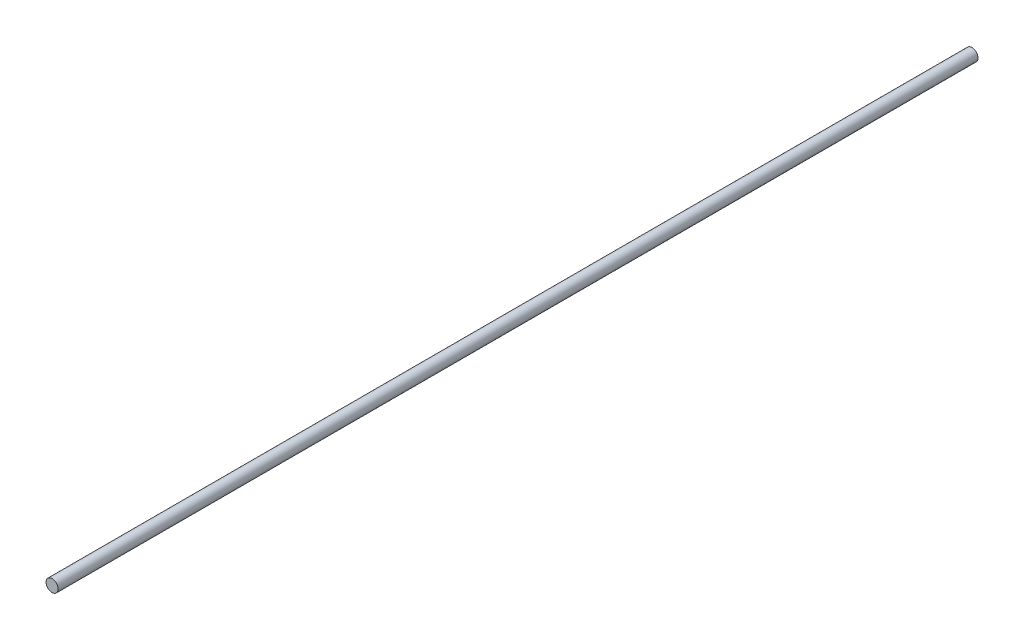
from build123d import *

# Parameters (mm, degrees)
SKETCH1_R           = 6.35
BOSS_EXTRUDE1_DEPTH = 482.6


with BuildPart() as part:
    # Sketch1 → Boss-Extrude1 (new, symmetric)
    with BuildSketch(Plane.XY):
        with Locations(Location((0, 0, 0), (0, 0, 180))):
            Circle(SKETCH1_R)
    extrude(amount=BOSS_EXTRUDE1_DEPTH, both=True)


solid = part.part
